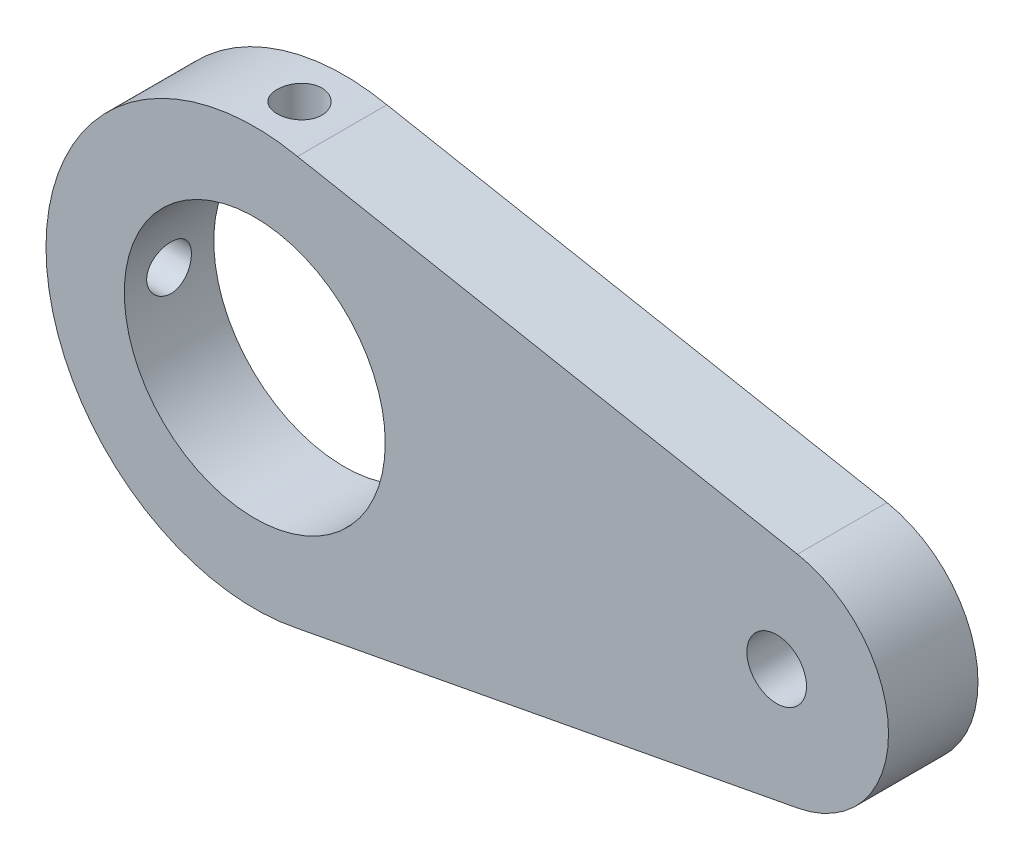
ISO-10303-21;
HEADER;
FILE_DESCRIPTION(('STEP AP214'),'2;1');
FILE_NAME('part.step','',(''),(''),'','','');
FILE_SCHEMA(('AUTOMOTIVE_DESIGN { 1 0 10303 214 1 1 1 1 }'));
ENDSEC;
DATA;
#1=APPLICATION_CONTEXT('core data for automotive mechanical design processes');
#2=APPLICATION_PROTOCOL_DEFINITION('international standard','automotive_design',2000,#1);
#3=PRODUCT_CONTEXT('',#1,'mechanical');
#4=PRODUCT('Part','Part','',(#3));
#5=PRODUCT_RELATED_PRODUCT_CATEGORY('part','',(#4));
#6=PRODUCT_DEFINITION_FORMATION('','',#4);
#7=PRODUCT_DEFINITION_CONTEXT('part definition',#1,'design');
#8=PRODUCT_DEFINITION('design','',#6,#7);
#9=PRODUCT_DEFINITION_SHAPE('','',#8);
#10=(LENGTH_UNIT() NAMED_UNIT(*) SI_UNIT(.MILLI.,.METRE.));
#11=(NAMED_UNIT(*) PLANE_ANGLE_UNIT() SI_UNIT($,.RADIAN.));
#12=(NAMED_UNIT(*) SI_UNIT($,.STERADIAN.) SOLID_ANGLE_UNIT());
#13=UNCERTAINTY_MEASURE_WITH_UNIT(LENGTH_MEASURE(1.E-05),#10,'distance_accuracy_value','');
#14=(GEOMETRIC_REPRESENTATION_CONTEXT(3) GLOBAL_UNCERTAINTY_ASSIGNED_CONTEXT((#13)) GLOBAL_UNIT_ASSIGNED_CONTEXT((#10,
#11,#12)) REPRESENTATION_CONTEXT('',''));
#15=CARTESIAN_POINT('',(0.,0.,0.));
#16=DIRECTION('',(0.,0.,1.));
#17=DIRECTION('',(1.,0.,0.));
#18=AXIS2_PLACEMENT_3D('',#15,#16,#17);
#19=CARTESIAN_POINT('',(0.,0.,12.));
#20=DIRECTION('',(0.,0.,-1.));
#21=DIRECTION('',(-1.,0.,0.));
#22=AXIS2_PLACEMENT_3D('',#19,#20,#21);
#23=CYLINDRICAL_SURFACE('',#22,28.);
#24=CARTESIAN_POINT('',(0.,28.,9.));
#25=CARTESIAN_POINT('',(-0.167994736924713,27.9999979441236,8.99999275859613));
#26=CARTESIAN_POINT('',(-0.336098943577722,27.9984720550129,8.98584135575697));
#27=CARTESIAN_POINT('',(-0.667642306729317,27.9925317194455,8.92960483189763));
#28=CARTESIAN_POINT('',(-0.831076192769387,27.9881141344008,8.88748935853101));
#29=CARTESIAN_POINT('',(-1.14843017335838,27.9768888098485,8.77656877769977));
#30=CARTESIAN_POINT('',(-1.30235611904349,27.9700825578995,8.70778027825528));
#31=CARTESIAN_POINT('',(-1.59644532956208,27.9548398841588,8.54549966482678));
#32=CARTESIAN_POINT('',(-1.73661122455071,27.9464037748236,8.45201228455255));
#33=CARTESIAN_POINT('',(-1.99980893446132,27.928806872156,8.2425765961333));
#34=CARTESIAN_POINT('',(-2.12277630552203,27.9196435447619,8.12654750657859));
#35=CARTESIAN_POINT('',(-2.34753215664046,27.9016457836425,7.87549475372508));
#36=CARTESIAN_POINT('',(-2.44931963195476,27.8928113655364,7.74047018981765));
#37=CARTESIAN_POINT('',(-2.62905806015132,27.8764461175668,7.4548514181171));
#38=CARTESIAN_POINT('',(-2.70695009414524,27.8689185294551,7.30421993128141));
#39=CARTESIAN_POINT('',(-2.83631035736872,27.8560513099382,6.99192108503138));
#40=CARTESIAN_POINT('',(-2.88777933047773,27.8507116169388,6.83025403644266));
#41=CARTESIAN_POINT('',(-2.96263998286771,27.8428480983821,6.50113406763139));
#42=CARTESIAN_POINT('',(-2.9861391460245,27.8403134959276,6.33370585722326));
#43=CARTESIAN_POINT('',(-3.00472546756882,27.8383138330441,5.99726420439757));
#44=CARTESIAN_POINT('',(-2.99981347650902,27.8388486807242,5.82825080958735));
#45=CARTESIAN_POINT('',(-2.96180541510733,27.8429176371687,5.49417951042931));
#46=CARTESIAN_POINT('',(-2.92882697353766,27.8464392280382,5.32910804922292));
#47=CARTESIAN_POINT('',(-2.8358053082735,27.85606533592,5.00685629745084));
#48=CARTESIAN_POINT('',(-2.77576167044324,27.8621698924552,4.84967612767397));
#49=CARTESIAN_POINT('',(-2.63018509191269,27.8762884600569,4.54729876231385));
#50=CARTESIAN_POINT('',(-2.54460024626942,27.8843063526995,4.40212674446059));
#51=CARTESIAN_POINT('',(-2.35040794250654,27.9013449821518,4.12816219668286));
#52=CARTESIAN_POINT('',(-2.24179971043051,27.9103657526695,3.99937021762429));
#53=CARTESIAN_POINT('',(-2.00398797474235,27.928449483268,3.76113834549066));
#54=CARTESIAN_POINT('',(-1.87468293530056,27.9375124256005,3.65179978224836));
#55=CARTESIAN_POINT('',(-1.59949986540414,27.9546163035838,3.45636478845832));
#56=CARTESIAN_POINT('',(-1.45362181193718,27.9626572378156,3.37026839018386));
#57=CARTESIAN_POINT('',(-1.14936135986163,27.9768143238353,3.22376466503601));
#58=CARTESIAN_POINT('',(-0.990976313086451,27.9829300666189,3.16336279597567));
#59=CARTESIAN_POINT('',(-0.666232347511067,27.992543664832,3.07003860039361));
#60=CARTESIAN_POINT('',(-0.499873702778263,27.9960416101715,3.03711533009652));
#61=CARTESIAN_POINT('',(-0.164782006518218,28.0000139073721,2.9998121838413));
#62=CARTESIAN_POINT('',(0.00393531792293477,28.0005030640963,2.99529254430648));
#63=CARTESIAN_POINT('',(0.339724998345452,27.998442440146,3.01455740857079));
#64=CARTESIAN_POINT('',(0.506797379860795,27.9958927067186,3.03834147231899));
#65=CARTESIAN_POINT('',(0.834148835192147,27.9880501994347,3.11342260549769));
#66=CARTESIAN_POINT('',(0.99444316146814,27.9827639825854,3.16465391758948));
#67=CARTESIAN_POINT('',(1.30416325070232,27.970041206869,3.29310749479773));
#68=CARTESIAN_POINT('',(1.45358873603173,27.9626045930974,3.370330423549));
#69=CARTESIAN_POINT('',(1.73795939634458,27.9463751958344,3.54891954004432));
#70=CARTESIAN_POINT('',(1.87284684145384,27.9375773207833,3.65037718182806));
#71=CARTESIAN_POINT('',(2.12372730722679,27.9196280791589,3.87442504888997));
#72=CARTESIAN_POINT('',(2.23971978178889,27.9104767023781,3.99701588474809));
#73=CARTESIAN_POINT('',(2.45000579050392,27.8928070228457,4.2604616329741));
#74=CARTESIAN_POINT('',(2.54420735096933,27.8842915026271,4.40139017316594));
#75=CARTESIAN_POINT('',(2.70760441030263,27.8689009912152,4.69714929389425));
#76=CARTESIAN_POINT('',(2.77680029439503,27.8620259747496,4.85197966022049));
#77=CARTESIAN_POINT('',(2.88806913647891,27.8507127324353,5.17083687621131));
#78=CARTESIAN_POINT('',(2.93019606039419,27.8462696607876,5.3348447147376));
#79=CARTESIAN_POINT('',(2.98630593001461,27.8403086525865,5.66765631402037));
#80=CARTESIAN_POINT('',(3.00028981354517,27.8387906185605,5.83645991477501));
#81=CARTESIAN_POINT('',(2.99970253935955,27.838853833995,6.17315698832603));
#82=CARTESIAN_POINT('',(2.9852758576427,27.8404194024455,6.34105073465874));
#83=CARTESIAN_POINT('',(2.92858069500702,27.8464399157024,6.67201425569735));
#84=CARTESIAN_POINT('',(2.88631218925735,27.8508948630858,6.83508402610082));
#85=CARTESIAN_POINT('',(2.77517453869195,27.862187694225,7.15176474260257));
#86=CARTESIAN_POINT('',(2.70631036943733,27.8690251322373,7.3053774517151));
#87=CARTESIAN_POINT('',(2.54395080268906,27.8843134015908,7.59888796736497));
#88=CARTESIAN_POINT('',(2.45045542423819,27.8927642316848,7.73878578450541));
#89=CARTESIAN_POINT('',(2.24094619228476,27.9103786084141,8.00163552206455));
#90=CARTESIAN_POINT('',(2.12482459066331,27.9195454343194,8.12450134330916));
#91=CARTESIAN_POINT('',(1.87357687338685,27.9375291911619,8.34906387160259));
#92=CARTESIAN_POINT('',(1.73844623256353,27.9463460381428,8.45075552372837));
#93=CARTESIAN_POINT('',(1.45258857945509,27.9626630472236,8.63031691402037));
#94=CARTESIAN_POINT('',(1.3018182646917,27.970159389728,8.70811801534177));
#95=CARTESIAN_POINT('',(0.989366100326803,27.9829502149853,8.83719300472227));
#96=CARTESIAN_POINT('',(0.827696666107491,27.9882471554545,8.88849651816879));
#97=CARTESIAN_POINT('',(0.554276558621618,27.9947255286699,8.9504612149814));
#98=CARTESIAN_POINT('',(0.444267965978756,27.9966941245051,8.96901253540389));
#99=CARTESIAN_POINT('',(0.222855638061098,27.9993320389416,8.99378429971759));
#100=CARTESIAN_POINT('',(0.111451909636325,28.0000013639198,9.00000480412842));
#101=CARTESIAN_POINT('',(0.,28.,9.));
#102=B_SPLINE_CURVE_WITH_KNOTS('',3,(#24,#25,#26,#27,#28,#29,#30,#31,#32,#33,#34,#35,#36,#37,
#38,#39,#40,#41,#42,#43,#44,#45,#46,#47,#48,#49,#50,#51,#52,#53,#54,#55,#56,#57,#58,#59,#60,#61,
#62,#63,#64,#65,#66,#67,#68,#69,#70,#71,#72,#73,#74,#75,#76,#77,#78,#79,#80,#81,#82,#83,#84,#85,
#86,#87,#88,#89,#90,#91,#92,#93,#94,#95,#96,#97,#98,#99,#100,#101),.UNSPECIFIED.,.T.,.F.,(4,2,2,
2,2,2,2,2,2,2,2,2,2,2,2,2,2,2,2,2,2,2,2,2,2,2,2,2,2,2,2,2,2,2,2,2,2,2,4),(0.,0.503577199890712,
1.0077018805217,1.5115131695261,2.01522796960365,2.52078235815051,3.02636072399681,
3.53317585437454,4.03997671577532,4.54482366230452,5.04965549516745,5.55238189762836,
6.05511599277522,6.55887878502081,7.062658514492,7.56899007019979,8.07532232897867,
8.58176208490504,9.08818444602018,9.59211292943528,10.0960335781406,10.5987523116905,
11.101483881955,11.6061434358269,12.1108175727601,12.6175844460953,13.1243435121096,
13.6300891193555,14.135817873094,14.6389814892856,15.1421455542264,15.6452155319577,
16.1482851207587,16.6538116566,17.1594587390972,17.6665452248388,18.1730635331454,
18.5071508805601,18.8412365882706),.UNSPECIFIED.);
#103=CARTESIAN_POINT('',(0.,28.,9.));
#104=VERTEX_POINT('',#103);
#105=EDGE_CURVE('E121',#104,#104,#102,.T.);
#106=ORIENTED_EDGE('',*,*,#105,.T.);
#107=EDGE_LOOP('',(#106));
#108=FACE_BOUND('',#107,.T.);
#109=CARTESIAN_POINT('',(0.,0.,0.));
#110=DIRECTION('',(0.,0.,1.));
#111=DIRECTION('',(1.,0.,0.));
#112=AXIS2_PLACEMENT_3D('',#109,#110,#111);
#113=CIRCLE('',#112,28.);
#114=CARTESIAN_POINT('',(5.72559171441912,27.408349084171,0.));
#115=VERTEX_POINT('',#114);
#116=CARTESIAN_POINT('',(5.72559171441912,-27.408349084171,0.));
#117=VERTEX_POINT('',#116);
#118=EDGE_CURVE('E108',#115,#117,#113,.T.);
#119=ORIENTED_EDGE('',*,*,#118,.T.);
#120=DIRECTION('',(0.,0.,-1.));
#121=VECTOR('',#120,1.);
#122=CARTESIAN_POINT('',(5.72559171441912,-27.408349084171,12.));
#123=LINE('',#122,#121);
#124=CARTESIAN_POINT('',(5.72559171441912,-27.408349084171,12.));
#125=VERTEX_POINT('',#124);
#126=EDGE_CURVE('E11',#125,#117,#123,.T.);
#127=ORIENTED_EDGE('',*,*,#126,.F.);
#128=CARTESIAN_POINT('',(0.,0.,12.));
#129=DIRECTION('',(0.,0.,1.));
#130=DIRECTION('',(1.,0.,0.));
#131=AXIS2_PLACEMENT_3D('',#128,#129,#130);
#132=CIRCLE('',#131,28.);
#133=CARTESIAN_POINT('',(5.72559171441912,27.408349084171,12.));
#134=VERTEX_POINT('',#133);
#135=EDGE_CURVE('E95',#134,#125,#132,.T.);
#136=ORIENTED_EDGE('',*,*,#135,.F.);
#137=DIRECTION('',(0.,0.,-1.));
#138=VECTOR('',#137,1.);
#139=CARTESIAN_POINT('',(5.72559171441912,27.408349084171,12.));
#140=LINE('',#139,#138);
#141=EDGE_CURVE('E104',#134,#115,#140,.T.);
#142=ORIENTED_EDGE('',*,*,#141,.T.);
#143=EDGE_LOOP('',(#119,#127,#136,#142));
#144=FACE_BOUND('',#143,.T.);
#145=CARTESIAN_POINT('',(-28.,0.,9.));
#146=CARTESIAN_POINT('',(-27.9999979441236,0.167994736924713,8.99999275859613));
#147=CARTESIAN_POINT('',(-27.9984720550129,0.336098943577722,8.98584135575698));
#148=CARTESIAN_POINT('',(-27.9925317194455,0.667642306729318,8.92960483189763));
#149=CARTESIAN_POINT('',(-27.9881141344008,0.831076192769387,8.88748935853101));
#150=CARTESIAN_POINT('',(-27.9768888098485,1.14843017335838,8.77656877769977));
#151=CARTESIAN_POINT('',(-27.9700825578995,1.30235611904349,8.70778027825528));
#152=CARTESIAN_POINT('',(-27.9548398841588,1.59644532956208,8.54549966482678));
#153=CARTESIAN_POINT('',(-27.9464037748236,1.73661122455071,8.45201228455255));
#154=CARTESIAN_POINT('',(-27.928806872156,1.99980893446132,8.2425765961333));
#155=CARTESIAN_POINT('',(-27.9196435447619,2.12277630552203,8.12654750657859));
#156=CARTESIAN_POINT('',(-27.9016457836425,2.34753215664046,7.87549475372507));
#157=CARTESIAN_POINT('',(-27.8928113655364,2.44931963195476,7.74047018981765));
#158=CARTESIAN_POINT('',(-27.8764461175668,2.62905806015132,7.4548514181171));
#159=CARTESIAN_POINT('',(-27.8689185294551,2.70695009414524,7.30421993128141));
#160=CARTESIAN_POINT('',(-27.8560513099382,2.83631035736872,6.99192108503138));
#161=CARTESIAN_POINT('',(-27.8507116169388,2.88777933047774,6.83025403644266));
#162=CARTESIAN_POINT('',(-27.8428480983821,2.96263998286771,6.50113406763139));
#163=CARTESIAN_POINT('',(-27.8403134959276,2.98613914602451,6.33370585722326));
#164=CARTESIAN_POINT('',(-27.8383138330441,3.00472546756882,5.99726420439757));
#165=CARTESIAN_POINT('',(-27.8388486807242,2.99981347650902,5.82825080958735));
#166=CARTESIAN_POINT('',(-27.8429176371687,2.96180541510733,5.49417951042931));
#167=CARTESIAN_POINT('',(-27.8464392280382,2.92882697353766,5.32910804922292));
#168=CARTESIAN_POINT('',(-27.85606533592,2.8358053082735,5.00685629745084));
#169=CARTESIAN_POINT('',(-27.8621698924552,2.77576167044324,4.84967612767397));
#170=CARTESIAN_POINT('',(-27.8762884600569,2.63018509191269,4.54729876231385));
#171=CARTESIAN_POINT('',(-27.8843063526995,2.54460024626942,4.40212674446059));
#172=CARTESIAN_POINT('',(-27.9013449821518,2.35040794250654,4.12816219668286));
#173=CARTESIAN_POINT('',(-27.9103657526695,2.24179971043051,3.99937021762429));
#174=CARTESIAN_POINT('',(-27.928449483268,2.00398797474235,3.76113834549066));
#175=CARTESIAN_POINT('',(-27.9375124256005,1.87468293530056,3.65179978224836));
#176=CARTESIAN_POINT('',(-27.9546163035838,1.59949986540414,3.45636478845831));
#177=CARTESIAN_POINT('',(-27.9626572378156,1.45362181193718,3.37026839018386));
#178=CARTESIAN_POINT('',(-27.9768143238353,1.14936135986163,3.22376466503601));
#179=CARTESIAN_POINT('',(-27.9829300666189,0.99097631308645,3.16336279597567));
#180=CARTESIAN_POINT('',(-27.992543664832,0.666232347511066,3.07003860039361));
#181=CARTESIAN_POINT('',(-27.9960416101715,0.499873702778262,3.03711533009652));
#182=CARTESIAN_POINT('',(-28.0000139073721,0.164782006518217,2.9998121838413));
#183=CARTESIAN_POINT('',(-28.0005030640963,-0.0039353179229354,2.99529254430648));
#184=CARTESIAN_POINT('',(-27.998442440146,-0.339724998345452,3.01455740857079));
#185=CARTESIAN_POINT('',(-27.9958927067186,-0.506797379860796,3.03834147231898));
#186=CARTESIAN_POINT('',(-27.9880501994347,-0.834148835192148,3.11342260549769));
#187=CARTESIAN_POINT('',(-27.9827639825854,-0.994443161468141,3.16465391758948));
#188=CARTESIAN_POINT('',(-27.970041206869,-1.30416325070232,3.29310749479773));
#189=CARTESIAN_POINT('',(-27.9626045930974,-1.45358873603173,3.370330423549));
#190=CARTESIAN_POINT('',(-27.9463751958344,-1.73795939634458,3.54891954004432));
#191=CARTESIAN_POINT('',(-27.9375773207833,-1.87284684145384,3.65037718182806));
#192=CARTESIAN_POINT('',(-27.9196280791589,-2.12372730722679,3.87442504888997));
#193=CARTESIAN_POINT('',(-27.9104767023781,-2.23971978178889,3.99701588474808));
#194=CARTESIAN_POINT('',(-27.8928070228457,-2.45000579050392,4.2604616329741));
#195=CARTESIAN_POINT('',(-27.8842915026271,-2.54420735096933,4.40139017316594));
#196=CARTESIAN_POINT('',(-27.8689009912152,-2.70760441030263,4.69714929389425));
#197=CARTESIAN_POINT('',(-27.8620259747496,-2.77680029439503,4.85197966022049));
#198=CARTESIAN_POINT('',(-27.8507127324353,-2.88806913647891,5.17083687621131));
#199=CARTESIAN_POINT('',(-27.8462696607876,-2.93019606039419,5.3348447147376));
#200=CARTESIAN_POINT('',(-27.8403086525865,-2.98630593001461,5.66765631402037));
#201=CARTESIAN_POINT('',(-27.8387906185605,-3.00028981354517,5.83645991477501));
#202=CARTESIAN_POINT('',(-27.838853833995,-2.99970253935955,6.17315698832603));
#203=CARTESIAN_POINT('',(-27.8404194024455,-2.9852758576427,6.34105073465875));
#204=CARTESIAN_POINT('',(-27.8464399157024,-2.92858069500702,6.67201425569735));
#205=CARTESIAN_POINT('',(-27.8508948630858,-2.88631218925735,6.83508402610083));
#206=CARTESIAN_POINT('',(-27.862187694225,-2.77517453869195,7.15176474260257));
#207=CARTESIAN_POINT('',(-27.8690251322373,-2.70631036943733,7.3053774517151));
#208=CARTESIAN_POINT('',(-27.8843134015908,-2.54395080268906,7.59888796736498));
#209=CARTESIAN_POINT('',(-27.8927642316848,-2.45045542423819,7.73878578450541));
#210=CARTESIAN_POINT('',(-27.9103786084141,-2.24094619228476,8.00163552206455));
#211=CARTESIAN_POINT('',(-27.9195454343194,-2.12482459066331,8.12450134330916));
#212=CARTESIAN_POINT('',(-27.9375291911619,-1.87357687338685,8.34906387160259));
#213=CARTESIAN_POINT('',(-27.9463460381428,-1.73844623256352,8.45075552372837));
#214=CARTESIAN_POINT('',(-27.9626630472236,-1.45258857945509,8.63031691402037));
#215=CARTESIAN_POINT('',(-27.970159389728,-1.30181826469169,8.70811801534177));
#216=CARTESIAN_POINT('',(-27.9829502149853,-0.989366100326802,8.83719300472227));
#217=CARTESIAN_POINT('',(-27.9882471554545,-0.82769666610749,8.88849651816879));
#218=CARTESIAN_POINT('',(-27.9947255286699,-0.554276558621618,8.9504612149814));
#219=CARTESIAN_POINT('',(-27.9966941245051,-0.444267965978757,8.96901253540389));
#220=CARTESIAN_POINT('',(-27.9993320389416,-0.222855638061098,8.99378429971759));
#221=CARTESIAN_POINT('',(-28.0000013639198,-0.111451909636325,9.00000480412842));
#222=CARTESIAN_POINT('',(-28.,0.,9.));
#223=B_SPLINE_CURVE_WITH_KNOTS('',3,(#145,#146,#147,#148,#149,#150,#151,#152,#153,#154,#155,
#156,#157,#158,#159,#160,#161,#162,#163,#164,#165,#166,#167,#168,#169,#170,#171,#172,#173,#174,
#175,#176,#177,#178,#179,#180,#181,#182,#183,#184,#185,#186,#187,#188,#189,#190,#191,#192,#193,
#194,#195,#196,#197,#198,#199,#200,#201,#202,#203,#204,#205,#206,#207,#208,#209,#210,#211,#212,
#213,#214,#215,#216,#217,#218,#219,#220,#221,#222),.UNSPECIFIED.,.T.,.F.,(4,2,2,2,2,2,2,2,2,2,2,
2,2,2,2,2,2,2,2,2,2,2,2,2,2,2,2,2,2,2,2,2,2,2,2,2,2,2,4),(0.,0.503577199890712,1.0077018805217,
1.5115131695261,2.01522796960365,2.52078235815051,3.02636072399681,3.53317585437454,
4.03997671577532,4.54482366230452,5.04965549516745,5.55238189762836,6.05511599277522,
6.55887878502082,7.062658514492,7.56899007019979,8.07532232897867,8.58176208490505,
9.08818444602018,9.59211292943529,10.0960335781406,10.5987523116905,11.101483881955,
11.6061434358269,12.1108175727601,12.6175844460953,13.1243435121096,13.6300891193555,
14.135817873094,14.6389814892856,15.1421455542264,15.6452155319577,16.1482851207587,
16.6538116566,17.1594587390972,17.6665452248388,18.1730635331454,18.5071508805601,
18.8412365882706),.UNSPECIFIED.);
#224=CARTESIAN_POINT('',(-28.,0.,9.));
#225=VERTEX_POINT('',#224);
#226=EDGE_CURVE('E122',#225,#225,#223,.T.);
#227=ORIENTED_EDGE('',*,*,#226,.F.);
#228=EDGE_LOOP('',(#227));
#229=FACE_BOUND('',#228,.T.);
#230=ADVANCED_FACE('F36',(#108,#144,#229),#23,.T.);
#231=CARTESIAN_POINT('',(0.,0.,12.));
#232=DIRECTION('',(0.,0.,-1.));
#233=DIRECTION('',(-1.,0.,0.));
#234=AXIS2_PLACEMENT_3D('',#231,#232,#233);
#235=CYLINDRICAL_SURFACE('',#234,17.5);
#236=CARTESIAN_POINT('',(0.,0.,0.));
#237=DIRECTION('',(0.,0.,1.));
#238=DIRECTION('',(1.,0.,0.));
#239=AXIS2_PLACEMENT_3D('',#236,#237,#238);
#240=CIRCLE('',#239,17.5);
#241=CARTESIAN_POINT('',(17.5,0.,0.));
#242=VERTEX_POINT('',#241);
#243=EDGE_CURVE('E147',#242,#242,#240,.T.);
#244=ORIENTED_EDGE('',*,*,#243,.F.);
#245=EDGE_LOOP('',(#244));
#246=FACE_BOUND('',#245,.T.);
#247=CARTESIAN_POINT('',(0.,0.,12.));
#248=DIRECTION('',(0.,0.,1.));
#249=DIRECTION('',(1.,0.,0.));
#250=AXIS2_PLACEMENT_3D('',#247,#248,#249);
#251=CIRCLE('',#250,17.5);
#252=CARTESIAN_POINT('',(17.5,0.,12.));
#253=VERTEX_POINT('',#252);
#254=EDGE_CURVE('E111',#253,#253,#251,.T.);
#255=ORIENTED_EDGE('',*,*,#254,.T.);
#256=EDGE_LOOP('',(#255));
#257=FACE_BOUND('',#256,.T.);
#258=CARTESIAN_POINT('',(0.,17.5,9.));
#259=CARTESIAN_POINT('',(-0.167197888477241,17.4999970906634,8.99999336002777));
#260=CARTESIAN_POINT('',(-0.33448525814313,17.4975789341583,8.9859752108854));
#261=CARTESIAN_POINT('',(-0.664363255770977,17.4881653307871,8.9302990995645));
#262=CARTESIAN_POINT('',(-0.826949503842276,17.4811657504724,8.88861617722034));
#263=CARTESIAN_POINT('',(-1.14260529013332,17.4633739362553,8.77891008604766));
#264=CARTESIAN_POINT('',(-1.29568266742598,17.4525848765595,8.7109089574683));
#265=CARTESIAN_POINT('',(-1.58823673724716,17.4283986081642,8.55055555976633));
#266=CARTESIAN_POINT('',(-1.72771488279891,17.4150016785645,8.45820589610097));
#267=CARTESIAN_POINT('',(-1.99053687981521,17.3869322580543,8.25078614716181));
#268=CARTESIAN_POINT('',(-2.11372361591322,17.3722493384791,8.13551837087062));
#269=CARTESIAN_POINT('',(-2.33910834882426,17.3433420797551,7.88595990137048));
#270=CARTESIAN_POINT('',(-2.44130498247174,17.3291177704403,7.75166797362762));
#271=CARTESIAN_POINT('',(-2.62244343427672,17.3026372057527,7.46678711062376));
#272=CARTESIAN_POINT('',(-2.70122890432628,17.2903944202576,7.31609740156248));
#273=CARTESIAN_POINT('',(-2.8323085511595,17.2694082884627,7.00337737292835));
#274=CARTESIAN_POINT('',(-2.88460462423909,17.2606646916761,6.84134786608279));
#275=CARTESIAN_POINT('',(-2.96072391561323,17.2477710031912,6.512216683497));
#276=CARTESIAN_POINT('',(-2.98481900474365,17.243577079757,6.34517963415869));
#277=CARTESIAN_POINT('',(-3.00469550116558,17.2401251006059,6.00938486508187));
#278=CARTESIAN_POINT('',(-3.00047902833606,17.2408666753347,5.8406272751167));
#279=CARTESIAN_POINT('',(-2.9640733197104,17.247161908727,5.5081288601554));
#280=CARTESIAN_POINT('',(-2.93219030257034,17.2526628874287,5.34435336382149));
#281=CARTESIAN_POINT('',(-2.84183747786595,17.2677745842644,5.02451108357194));
#282=CARTESIAN_POINT('',(-2.78336671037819,17.277385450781,4.86844457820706));
#283=CARTESIAN_POINT('',(-2.64119011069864,17.2996905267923,4.56753825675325));
#284=CARTESIAN_POINT('',(-2.55735789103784,17.3124001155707,4.42275934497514));
#285=CARTESIAN_POINT('',(-2.36692773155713,17.3394600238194,4.14920752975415));
#286=CARTESIAN_POINT('',(-2.26032785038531,17.3538104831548,4.02043599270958));
#287=CARTESIAN_POINT('',(-2.02572372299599,17.3827662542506,3.78078244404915));
#288=CARTESIAN_POINT('',(-1.89745691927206,17.3973724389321,3.67015740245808));
#289=CARTESIAN_POINT('',(-1.62404588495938,17.425020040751,3.47196054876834));
#290=CARTESIAN_POINT('',(-1.47890153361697,17.4380614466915,3.38438890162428));
#291=CARTESIAN_POINT('',(-1.17560813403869,17.4611302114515,3.23475815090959));
#292=CARTESIAN_POINT('',(-1.01744722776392,17.4711547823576,3.17272262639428));
#293=CARTESIAN_POINT('',(-0.692740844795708,17.4870382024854,3.0761681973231));
#294=CARTESIAN_POINT('',(-0.526196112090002,17.4928974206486,3.04164685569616));
#295=CARTESIAN_POINT('',(-0.191663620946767,17.4997401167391,3.00145111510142));
#296=CARTESIAN_POINT('',(-0.0237194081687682,17.5007831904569,2.99542410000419));
#297=CARTESIAN_POINT('',(0.310778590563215,17.4980396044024,3.01144674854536));
#298=CARTESIAN_POINT('',(0.477332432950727,17.4942531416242,3.03349526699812));
#299=CARTESIAN_POINT('',(0.803226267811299,17.4823128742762,3.1047498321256));
#300=CARTESIAN_POINT('',(0.962605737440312,17.474187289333,3.15378046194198));
#301=CARTESIAN_POINT('',(1.27088253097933,17.4544761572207,3.27741983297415));
#302=CARTESIAN_POINT('',(1.41977923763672,17.4428904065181,3.35203007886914));
#303=CARTESIAN_POINT('',(1.70438969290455,17.417396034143,3.52551241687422));
#304=CARTESIAN_POINT('',(1.83996793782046,17.4034668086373,3.62460372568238));
#305=CARTESIAN_POINT('',(2.09269752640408,17.374890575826,3.8439348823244));
#306=CARTESIAN_POINT('',(2.20984744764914,17.3602435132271,3.9641763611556));
#307=CARTESIAN_POINT('',(2.42370922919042,17.3316886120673,4.22397948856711));
#308=CARTESIAN_POINT('',(2.52018230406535,17.3177906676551,4.36373895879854));
#309=CARTESIAN_POINT('',(2.68828177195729,17.2924954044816,4.65768722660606));
#310=CARTESIAN_POINT('',(2.75990898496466,17.2810980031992,4.8118755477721));
#311=CARTESIAN_POINT('',(2.87593039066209,17.2621692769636,5.1296504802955));
#312=CARTESIAN_POINT('',(2.92044137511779,17.2546213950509,5.29319341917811));
#313=CARTESIAN_POINT('',(2.98133287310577,17.2442055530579,5.62557546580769));
#314=CARTESIAN_POINT('',(2.99771598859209,17.2413371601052,5.79441408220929));
#315=CARTESIAN_POINT('',(3.00181092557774,17.2406244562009,6.13020881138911));
#316=CARTESIAN_POINT('',(2.98989876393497,17.2427142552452,6.29716031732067));
#317=CARTESIAN_POINT('',(2.93855658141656,17.2515376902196,6.62664551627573));
#318=CARTESIAN_POINT('',(2.89912666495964,17.2582713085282,6.78917922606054));
#319=CARTESIAN_POINT('',(2.79401555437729,17.2755980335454,7.10505721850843));
#320=CARTESIAN_POINT('',(2.72836856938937,17.2861861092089,7.25841317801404));
#321=CARTESIAN_POINT('',(2.57272591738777,17.3100332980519,7.55199555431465));
#322=CARTESIAN_POINT('',(2.4827289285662,17.3232925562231,7.6922212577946));
#323=CARTESIAN_POINT('',(2.27960652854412,17.3511960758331,7.95745891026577));
#324=CARTESIAN_POINT('',(2.1662051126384,17.36585562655,8.08225791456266));
#325=CARTESIAN_POINT('',(1.92007371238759,17.3947877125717,8.31118326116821));
#326=CARTESIAN_POINT('',(1.78733928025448,17.4090601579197,8.41530483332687));
#327=CARTESIAN_POINT('',(1.50514767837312,17.4357318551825,8.6006229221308));
#328=CARTESIAN_POINT('',(1.35557476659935,17.4481165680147,8.68164531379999));
#329=CARTESIAN_POINT('',(1.04478686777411,17.4694759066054,8.81728768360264));
#330=CARTESIAN_POINT('',(0.883583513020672,17.4784538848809,8.8719336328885));
#331=CARTESIAN_POINT('',(0.601487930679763,17.4900568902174,8.94157686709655));
#332=CARTESIAN_POINT('',(0.482290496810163,17.4937653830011,8.96344994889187));
#333=CARTESIAN_POINT('',(0.242077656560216,17.4987379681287,8.99266378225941));
#334=CARTESIAN_POINT('',(0.121062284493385,17.5000021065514,9.00000480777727));
#335=CARTESIAN_POINT('',(0.,17.5,9.));
#336=B_SPLINE_CURVE_WITH_KNOTS('',3,(#258,#259,#260,#261,#262,#263,#264,#265,#266,#267,#268,
#269,#270,#271,#272,#273,#274,#275,#276,#277,#278,#279,#280,#281,#282,#283,#284,#285,#286,#287,
#288,#289,#290,#291,#292,#293,#294,#295,#296,#297,#298,#299,#300,#301,#302,#303,#304,#305,#306,
#307,#308,#309,#310,#311,#312,#313,#314,#315,#316,#317,#318,#319,#320,#321,#322,#323,#324,#325,
#326,#327,#328,#329,#330,#331,#332,#333,#334,#335),.UNSPECIFIED.,.T.,.F.,(4,2,2,2,2,2,2,2,2,2,2,
2,2,2,2,2,2,2,2,2,2,2,2,2,2,2,2,2,2,2,2,2,2,2,2,2,2,2,4),(0.,0.501151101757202,1.00275497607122,
1.50393968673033,2.00507078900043,2.5107284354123,3.01641891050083,3.52541434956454,
4.03437334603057,4.53838423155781,5.04235737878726,5.54082259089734,6.03930580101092,
6.54031528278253,7.04136750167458,7.54899572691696,8.05662758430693,8.56472712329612,
9.07278165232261,9.57453227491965,10.076262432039,10.5747686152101,11.0733041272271,
11.5764767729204,12.0796882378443,12.5884304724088,13.0971559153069,13.6036744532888,
14.1101461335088,14.6099250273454,15.1097020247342,15.6088290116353,16.1079830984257,
16.6133996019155,17.1189325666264,17.6281812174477,18.1369274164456,18.4998006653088,
18.8626670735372),.UNSPECIFIED.);
#337=CARTESIAN_POINT('',(0.,17.5,9.));
#338=VERTEX_POINT('',#337);
#339=EDGE_CURVE('E116',#338,#338,#336,.T.);
#340=ORIENTED_EDGE('',*,*,#339,.F.);
#341=EDGE_LOOP('',(#340));
#342=FACE_BOUND('',#341,.T.);
#343=CARTESIAN_POINT('',(-17.5,0.,9.));
#344=CARTESIAN_POINT('',(-17.4999970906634,0.167197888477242,8.99999336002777));
#345=CARTESIAN_POINT('',(-17.4975789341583,0.334485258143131,8.9859752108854));
#346=CARTESIAN_POINT('',(-17.4881653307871,0.664363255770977,8.9302990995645));
#347=CARTESIAN_POINT('',(-17.4811657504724,0.826949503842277,8.88861617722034));
#348=CARTESIAN_POINT('',(-17.4633739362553,1.14260529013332,8.77891008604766));
#349=CARTESIAN_POINT('',(-17.4525848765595,1.29568266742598,8.7109089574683));
#350=CARTESIAN_POINT('',(-17.4283986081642,1.58823673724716,8.55055555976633));
#351=CARTESIAN_POINT('',(-17.4150016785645,1.72771488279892,8.45820589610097));
#352=CARTESIAN_POINT('',(-17.3869322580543,1.99053687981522,8.25078614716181));
#353=CARTESIAN_POINT('',(-17.3722493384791,2.11372361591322,8.13551837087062));
#354=CARTESIAN_POINT('',(-17.3433420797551,2.33910834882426,7.88595990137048));
#355=CARTESIAN_POINT('',(-17.3291177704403,2.44130498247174,7.75166797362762));
#356=CARTESIAN_POINT('',(-17.3026372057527,2.62244343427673,7.46678711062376));
#357=CARTESIAN_POINT('',(-17.2903944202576,2.70122890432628,7.31609740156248));
#358=CARTESIAN_POINT('',(-17.2694082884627,2.8323085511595,7.00337737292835));
#359=CARTESIAN_POINT('',(-17.2606646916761,2.88460462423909,6.84134786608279));
#360=CARTESIAN_POINT('',(-17.2477710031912,2.96072391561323,6.512216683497));
#361=CARTESIAN_POINT('',(-17.243577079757,2.98481900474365,6.34517963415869));
#362=CARTESIAN_POINT('',(-17.2401251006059,3.00469550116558,6.00938486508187));
#363=CARTESIAN_POINT('',(-17.2408666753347,3.00047902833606,5.84062727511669));
#364=CARTESIAN_POINT('',(-17.247161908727,2.9640733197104,5.5081288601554));
#365=CARTESIAN_POINT('',(-17.2526628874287,2.93219030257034,5.34435336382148));
#366=CARTESIAN_POINT('',(-17.2677745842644,2.84183747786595,5.02451108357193));
#367=CARTESIAN_POINT('',(-17.277385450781,2.78336671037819,4.86844457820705));
#368=CARTESIAN_POINT('',(-17.2996905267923,2.64119011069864,4.56753825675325));
#369=CARTESIAN_POINT('',(-17.3124001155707,2.55735789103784,4.42275934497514));
#370=CARTESIAN_POINT('',(-17.3394600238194,2.36692773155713,4.14920752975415));
#371=CARTESIAN_POINT('',(-17.3538104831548,2.26032785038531,4.02043599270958));
#372=CARTESIAN_POINT('',(-17.3827662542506,2.02572372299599,3.78078244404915));
#373=CARTESIAN_POINT('',(-17.3973724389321,1.89745691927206,3.67015740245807));
#374=CARTESIAN_POINT('',(-17.425020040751,1.62404588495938,3.47196054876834));
#375=CARTESIAN_POINT('',(-17.4380614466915,1.47890153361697,3.38438890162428));
#376=CARTESIAN_POINT('',(-17.4611302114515,1.17560813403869,3.23475815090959));
#377=CARTESIAN_POINT('',(-17.4711547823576,1.01744722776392,3.17272262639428));
#378=CARTESIAN_POINT('',(-17.4870382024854,0.692740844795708,3.0761681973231));
#379=CARTESIAN_POINT('',(-17.4928974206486,0.526196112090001,3.04164685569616));
#380=CARTESIAN_POINT('',(-17.4997401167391,0.191663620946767,3.00145111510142));
#381=CARTESIAN_POINT('',(-17.5007831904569,0.0237194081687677,2.99542410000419));
#382=CARTESIAN_POINT('',(-17.4980396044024,-0.310778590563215,3.01144674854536));
#383=CARTESIAN_POINT('',(-17.4942531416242,-0.477332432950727,3.03349526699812));
#384=CARTESIAN_POINT('',(-17.4823128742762,-0.803226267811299,3.1047498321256));
#385=CARTESIAN_POINT('',(-17.474187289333,-0.962605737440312,3.15378046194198));
#386=CARTESIAN_POINT('',(-17.4544761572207,-1.27088253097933,3.27741983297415));
#387=CARTESIAN_POINT('',(-17.4428904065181,-1.41977923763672,3.35203007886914));
#388=CARTESIAN_POINT('',(-17.417396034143,-1.70438969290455,3.52551241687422));
#389=CARTESIAN_POINT('',(-17.4034668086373,-1.83996793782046,3.62460372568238));
#390=CARTESIAN_POINT('',(-17.374890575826,-2.09269752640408,3.8439348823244));
#391=CARTESIAN_POINT('',(-17.3602435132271,-2.20984744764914,3.9641763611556));
#392=CARTESIAN_POINT('',(-17.3316886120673,-2.42370922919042,4.22397948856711));
#393=CARTESIAN_POINT('',(-17.3177906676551,-2.52018230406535,4.36373895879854));
#394=CARTESIAN_POINT('',(-17.2924954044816,-2.68828177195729,4.65768722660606));
#395=CARTESIAN_POINT('',(-17.2810980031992,-2.75990898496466,4.8118755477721));
#396=CARTESIAN_POINT('',(-17.2621692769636,-2.87593039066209,5.1296504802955));
#397=CARTESIAN_POINT('',(-17.2546213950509,-2.9204413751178,5.29319341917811));
#398=CARTESIAN_POINT('',(-17.2442055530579,-2.98133287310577,5.62557546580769));
#399=CARTESIAN_POINT('',(-17.2413371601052,-2.99771598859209,5.79441408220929));
#400=CARTESIAN_POINT('',(-17.2406244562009,-3.00181092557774,6.13020881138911));
#401=CARTESIAN_POINT('',(-17.2427142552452,-2.98989876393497,6.29716031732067));
#402=CARTESIAN_POINT('',(-17.2515376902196,-2.93855658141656,6.62664551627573));
#403=CARTESIAN_POINT('',(-17.2582713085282,-2.89912666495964,6.78917922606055));
#404=CARTESIAN_POINT('',(-17.2755980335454,-2.79401555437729,7.10505721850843));
#405=CARTESIAN_POINT('',(-17.2861861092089,-2.72836856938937,7.25841317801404));
#406=CARTESIAN_POINT('',(-17.3100332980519,-2.57272591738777,7.55199555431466));
#407=CARTESIAN_POINT('',(-17.3232925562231,-2.4827289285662,7.6922212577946));
#408=CARTESIAN_POINT('',(-17.3511960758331,-2.27960652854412,7.95745891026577));
#409=CARTESIAN_POINT('',(-17.36585562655,-2.16620511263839,8.08225791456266));
#410=CARTESIAN_POINT('',(-17.3947877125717,-1.92007371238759,8.31118326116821));
#411=CARTESIAN_POINT('',(-17.4090601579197,-1.78733928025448,8.41530483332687));
#412=CARTESIAN_POINT('',(-17.4357318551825,-1.50514767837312,8.60062292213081));
#413=CARTESIAN_POINT('',(-17.4481165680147,-1.35557476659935,8.68164531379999));
#414=CARTESIAN_POINT('',(-17.4694759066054,-1.0447868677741,8.81728768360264));
#415=CARTESIAN_POINT('',(-17.4784538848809,-0.883583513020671,8.8719336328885));
#416=CARTESIAN_POINT('',(-17.4900568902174,-0.601487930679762,8.94157686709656));
#417=CARTESIAN_POINT('',(-17.4937653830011,-0.482290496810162,8.96344994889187));
#418=CARTESIAN_POINT('',(-17.4987379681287,-0.242077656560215,8.99266378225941));
#419=CARTESIAN_POINT('',(-17.5000021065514,-0.121062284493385,9.00000480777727));
#420=CARTESIAN_POINT('',(-17.5,0.,9.));
#421=B_SPLINE_CURVE_WITH_KNOTS('',3,(#343,#344,#345,#346,#347,#348,#349,#350,#351,#352,#353,
#354,#355,#356,#357,#358,#359,#360,#361,#362,#363,#364,#365,#366,#367,#368,#369,#370,#371,#372,
#373,#374,#375,#376,#377,#378,#379,#380,#381,#382,#383,#384,#385,#386,#387,#388,#389,#390,#391,
#392,#393,#394,#395,#396,#397,#398,#399,#400,#401,#402,#403,#404,#405,#406,#407,#408,#409,#410,
#411,#412,#413,#414,#415,#416,#417,#418,#419,#420),.UNSPECIFIED.,.T.,.F.,(4,2,2,2,2,2,2,2,2,2,2,
2,2,2,2,2,2,2,2,2,2,2,2,2,2,2,2,2,2,2,2,2,2,2,2,2,2,2,4),(0.,0.501151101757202,1.00275497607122,
1.50393968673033,2.00507078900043,2.5107284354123,3.01641891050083,3.52541434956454,
4.03437334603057,4.53838423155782,5.04235737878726,5.54082259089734,6.03930580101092,
6.54031528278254,7.04136750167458,7.54899572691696,8.05662758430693,8.56472712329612,
9.07278165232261,9.57453227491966,10.076262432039,10.5747686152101,11.0733041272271,
11.5764767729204,12.0796882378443,12.5884304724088,13.0971559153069,13.6036744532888,
14.1101461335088,14.6099250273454,15.1097020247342,15.6088290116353,16.1079830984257,
16.6133996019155,17.1189325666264,17.6281812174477,18.1369274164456,18.4998006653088,
18.8626670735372),.UNSPECIFIED.);
#422=CARTESIAN_POINT('',(-17.5,0.,9.));
#423=VERTEX_POINT('',#422);
#424=EDGE_CURVE('E40',#423,#423,#421,.T.);
#425=ORIENTED_EDGE('',*,*,#424,.T.);
#426=EDGE_LOOP('',(#425));
#427=FACE_BOUND('',#426,.T.);
#428=ADVANCED_FACE('F123',(#246,#257,#342,#427),#235,.F.);
#429=CARTESIAN_POINT('',(0.,0.,12.));
#430=DIRECTION('',(0.,0.,1.));
#431=DIRECTION('',(1.,0.,0.));
#432=AXIS2_PLACEMENT_3D('',#429,#430,#431);
#433=PLANE('',#432);
#434=ORIENTED_EDGE('',*,*,#254,.F.);
#435=EDGE_LOOP('',(#434));
#436=FACE_BOUND('',#435,.T.);
#437=ORIENTED_EDGE('',*,*,#135,.T.);
#438=DIRECTION('',(0.982617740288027,0.18564044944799,0.));
#439=VECTOR('',#438,1.);
#440=CARTESIAN_POINT('',(5.72559171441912,-27.408349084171,12.));
#441=LINE('',#440,#439);
#442=CARTESIAN_POINT('',(72.7846067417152,-14.7392661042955,12.));
#443=VERTEX_POINT('',#442);
#444=EDGE_CURVE('E89',#125,#443,#441,.T.);
#445=ORIENTED_EDGE('',*,*,#444,.T.);
#446=CARTESIAN_POINT('',(70.,0.,12.));
#447=DIRECTION('',(0.,0.,1.));
#448=DIRECTION('',(1.,0.,0.));
#449=AXIS2_PLACEMENT_3D('',#446,#447,#448);
#450=CIRCLE('',#449,14.9999999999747);
#451=CARTESIAN_POINT('',(72.7846067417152,14.7392661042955,12.));
#452=VERTEX_POINT('',#451);
#453=EDGE_CURVE('E93',#443,#452,#450,.T.);
#454=ORIENTED_EDGE('',*,*,#453,.T.);
#455=DIRECTION('',(-0.982617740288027,0.18564044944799,0.));
#456=VECTOR('',#455,1.);
#457=CARTESIAN_POINT('',(5.72559171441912,27.408349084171,12.));
#458=LINE('',#457,#456);
#459=EDGE_CURVE('E59',#452,#134,#458,.T.);
#460=ORIENTED_EDGE('',*,*,#459,.T.);
#461=EDGE_LOOP('',(#437,#445,#454,#460));
#462=FACE_BOUND('',#461,.T.);
#463=CARTESIAN_POINT('',(70.,0.,12.));
#464=DIRECTION('',(0.,0.,1.));
#465=DIRECTION('',(1.,0.,0.));
#466=AXIS2_PLACEMENT_3D('',#463,#464,#465);
#467=CIRCLE('',#466,4.00000000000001);
#468=CARTESIAN_POINT('',(74.,0.,12.));
#469=VERTEX_POINT('',#468);
#470=EDGE_CURVE('E144',#469,#469,#467,.T.);
#471=ORIENTED_EDGE('',*,*,#470,.F.);
#472=EDGE_LOOP('',(#471));
#473=FACE_BOUND('',#472,.T.);
#474=ADVANCED_FACE('F90',(#436,#462,#473),#433,.T.);
#475=CARTESIAN_POINT('',(0.,0.,0.));
#476=DIRECTION('',(0.,0.,1.));
#477=DIRECTION('',(1.,0.,0.));
#478=AXIS2_PLACEMENT_3D('',#475,#476,#477);
#479=PLANE('',#478);
#480=ORIENTED_EDGE('',*,*,#118,.F.);
#481=DIRECTION('',(-0.982617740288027,0.18564044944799,0.));
#482=VECTOR('',#481,1.);
#483=CARTESIAN_POINT('',(5.72559171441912,27.408349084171,0.));
#484=LINE('',#483,#482);
#485=CARTESIAN_POINT('',(72.7846067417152,14.7392661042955,0.));
#486=VERTEX_POINT('',#485);
#487=EDGE_CURVE('E82',#486,#115,#484,.T.);
#488=ORIENTED_EDGE('',*,*,#487,.F.);
#489=CARTESIAN_POINT('',(70.,0.,0.));
#490=DIRECTION('',(0.,0.,1.));
#491=DIRECTION('',(1.,0.,0.));
#492=AXIS2_PLACEMENT_3D('',#489,#490,#491);
#493=CIRCLE('',#492,14.9999999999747);
#494=CARTESIAN_POINT('',(72.7846067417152,-14.7392661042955,0.));
#495=VERTEX_POINT('',#494);
#496=EDGE_CURVE('E76',#495,#486,#493,.T.);
#497=ORIENTED_EDGE('',*,*,#496,.F.);
#498=DIRECTION('',(0.982617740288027,0.18564044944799,0.));
#499=VECTOR('',#498,1.);
#500=CARTESIAN_POINT('',(5.72559171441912,-27.408349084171,0.));
#501=LINE('',#500,#499);
#502=EDGE_CURVE('E99',#117,#495,#501,.T.);
#503=ORIENTED_EDGE('',*,*,#502,.F.);
#504=EDGE_LOOP('',(#480,#488,#497,#503));
#505=FACE_BOUND('',#504,.T.);
#506=ORIENTED_EDGE('',*,*,#243,.T.);
#507=EDGE_LOOP('',(#506));
#508=FACE_BOUND('',#507,.T.);
#509=CARTESIAN_POINT('',(70.,0.,0.));
#510=DIRECTION('',(0.,0.,1.));
#511=DIRECTION('',(1.,0.,0.));
#512=AXIS2_PLACEMENT_3D('',#509,#510,#511);
#513=CIRCLE('',#512,4.00000000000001);
#514=CARTESIAN_POINT('',(74.,0.,0.));
#515=VERTEX_POINT('',#514);
#516=EDGE_CURVE('E141',#515,#515,#513,.T.);
#517=ORIENTED_EDGE('',*,*,#516,.T.);
#518=EDGE_LOOP('',(#517));
#519=FACE_BOUND('',#518,.T.);
#520=ADVANCED_FACE('F155',(#505,#508,#519),#479,.F.);
#521=CARTESIAN_POINT('',(5.72559171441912,-27.408349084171,12.));
#522=DIRECTION('',(-0.185640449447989,0.982617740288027,0.));
#523=DIRECTION('',(-0.982617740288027,-0.18564044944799,0.));
#524=AXIS2_PLACEMENT_3D('',#521,#522,#523);
#525=PLANE('',#524);
#526=ORIENTED_EDGE('',*,*,#502,.T.);
#527=DIRECTION('',(0.,0.,-1.));
#528=VECTOR('',#527,1.);
#529=CARTESIAN_POINT('',(72.7846067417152,-14.7392661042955,12.));
#530=LINE('',#529,#528);
#531=EDGE_CURVE('E50',#443,#495,#530,.T.);
#532=ORIENTED_EDGE('',*,*,#531,.F.);
#533=ORIENTED_EDGE('',*,*,#444,.F.);
#534=ORIENTED_EDGE('',*,*,#126,.T.);
#535=EDGE_LOOP('',(#526,#532,#533,#534));
#536=FACE_BOUND('',#535,.T.);
#537=ADVANCED_FACE('F98',(#536),#525,.F.);
#538=CARTESIAN_POINT('',(70.,0.,12.));
#539=DIRECTION('',(0.,0.,-1.));
#540=DIRECTION('',(-1.,0.,0.));
#541=AXIS2_PLACEMENT_3D('',#538,#539,#540);
#542=CYLINDRICAL_SURFACE('',#541,14.9999999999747);
#543=ORIENTED_EDGE('',*,*,#496,.T.);
#544=DIRECTION('',(0.,0.,-1.));
#545=VECTOR('',#544,1.);
#546=CARTESIAN_POINT('',(72.7846067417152,14.7392661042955,12.));
#547=LINE('',#546,#545);
#548=EDGE_CURVE('E100',#452,#486,#547,.T.);
#549=ORIENTED_EDGE('',*,*,#548,.F.);
#550=ORIENTED_EDGE('',*,*,#453,.F.);
#551=ORIENTED_EDGE('',*,*,#531,.T.);
#552=EDGE_LOOP('',(#543,#549,#550,#551));
#553=FACE_BOUND('',#552,.T.);
#554=ADVANCED_FACE('F102',(#553),#542,.T.);
#555=CARTESIAN_POINT('',(5.72559171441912,27.408349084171,12.));
#556=DIRECTION('',(-0.185640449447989,-0.982617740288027,0.));
#557=DIRECTION('',(0.982617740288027,-0.18564044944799,0.));
#558=AXIS2_PLACEMENT_3D('',#555,#556,#557);
#559=PLANE('',#558);
#560=ORIENTED_EDGE('',*,*,#487,.T.);
#561=ORIENTED_EDGE('',*,*,#141,.F.);
#562=ORIENTED_EDGE('',*,*,#459,.F.);
#563=ORIENTED_EDGE('',*,*,#548,.T.);
#564=EDGE_LOOP('',(#560,#561,#562,#563));
#565=FACE_BOUND('',#564,.T.);
#566=ADVANCED_FACE('F187',(#565),#559,.F.);
#567=CARTESIAN_POINT('',(70.,0.,12.));
#568=DIRECTION('',(0.,0.,-1.));
#569=DIRECTION('',(-1.,0.,0.));
#570=AXIS2_PLACEMENT_3D('',#567,#568,#569);
#571=CYLINDRICAL_SURFACE('',#570,4.00000000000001);
#572=ORIENTED_EDGE('',*,*,#470,.T.);
#573=EDGE_LOOP('',(#572));
#574=FACE_BOUND('',#573,.T.);
#575=ORIENTED_EDGE('',*,*,#516,.F.);
#576=EDGE_LOOP('',(#575));
#577=FACE_BOUND('',#576,.T.);
#578=ADVANCED_FACE('F131',(#574,#577),#571,.F.);
#579=CARTESIAN_POINT('',(0.,16.,6.));
#580=DIRECTION('',(0.,1.,0.));
#581=DIRECTION('',(0.,0.,1.));
#582=AXIS2_PLACEMENT_3D('',#579,#580,#581);
#583=CYLINDRICAL_SURFACE('',#582,3.);
#584=ORIENTED_EDGE('',*,*,#339,.T.);
#585=EDGE_LOOP('',(#584));
#586=FACE_BOUND('',#585,.T.);
#587=ORIENTED_EDGE('',*,*,#105,.F.);
#588=EDGE_LOOP('',(#587));
#589=FACE_BOUND('',#588,.T.);
#590=ADVANCED_FACE('F127',(#586,#589),#583,.F.);
#591=CARTESIAN_POINT('',(-8.99999999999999,0.,6.));
#592=DIRECTION('',(-1.,0.,0.));
#593=DIRECTION('',(0.,0.,1.));
#594=AXIS2_PLACEMENT_3D('',#591,#592,#593);
#595=CYLINDRICAL_SURFACE('',#594,3.);
#596=ORIENTED_EDGE('',*,*,#424,.F.);
#597=EDGE_LOOP('',(#596));
#598=FACE_BOUND('',#597,.T.);
#599=ORIENTED_EDGE('',*,*,#226,.T.);
#600=EDGE_LOOP('',(#599));
#601=FACE_BOUND('',#600,.T.);
#602=ADVANCED_FACE('F130',(#598,#601),#595,.F.);
#603=CLOSED_SHELL('',(#230,#428,#474,#520,#537,#554,#566,#578,#590,#602));
#604=MANIFOLD_SOLID_BREP('B2',#603);
#605=ADVANCED_BREP_SHAPE_REPRESENTATION('',(#18,#604),#14);
#606=SHAPE_DEFINITION_REPRESENTATION(#9,#605);
ENDSEC;
END-ISO-10303-21;
